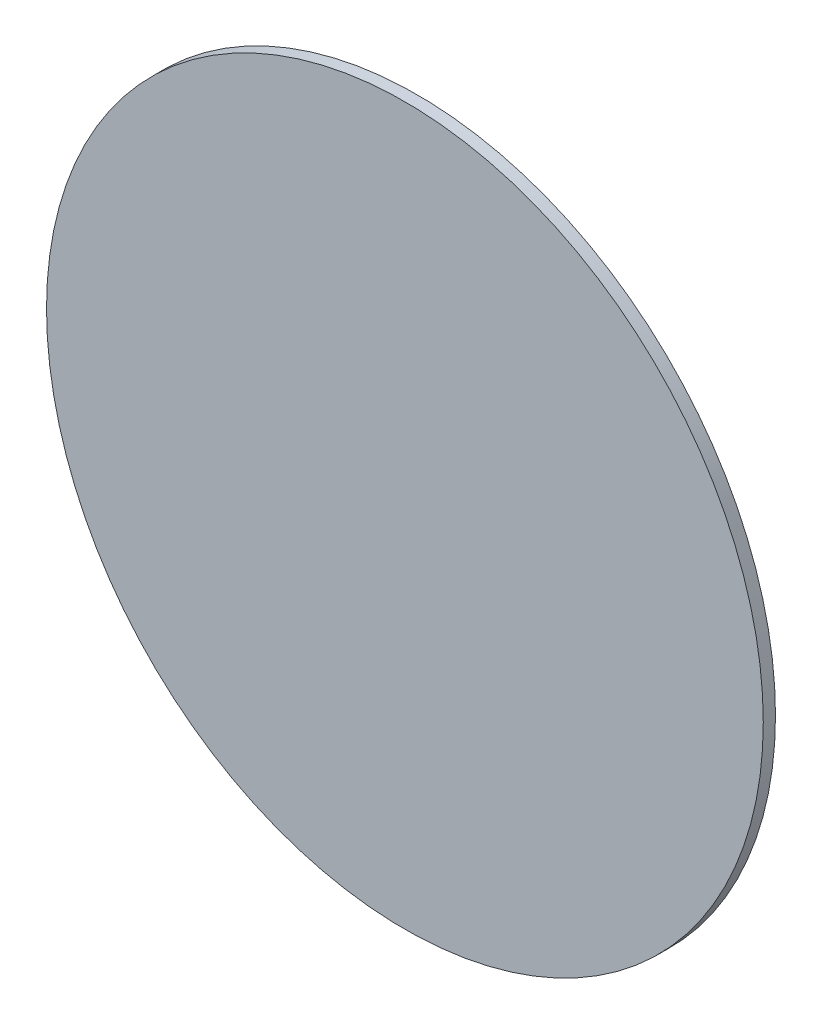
ISO-10303-21;
HEADER;
FILE_DESCRIPTION(('STEP AP214'),'2;1');
FILE_NAME('part.step','',(''),(''),'','','');
FILE_SCHEMA(('AUTOMOTIVE_DESIGN { 1 0 10303 214 1 1 1 1 }'));
ENDSEC;
DATA;
#1=APPLICATION_CONTEXT('core data for automotive mechanical design processes');
#2=APPLICATION_PROTOCOL_DEFINITION('international standard','automotive_design',2000,#1);
#3=PRODUCT_CONTEXT('',#1,'mechanical');
#4=PRODUCT('Part','Part','',(#3));
#5=PRODUCT_RELATED_PRODUCT_CATEGORY('part','',(#4));
#6=PRODUCT_DEFINITION_FORMATION('','',#4);
#7=PRODUCT_DEFINITION_CONTEXT('part definition',#1,'design');
#8=PRODUCT_DEFINITION('design','',#6,#7);
#9=PRODUCT_DEFINITION_SHAPE('','',#8);
#10=(LENGTH_UNIT() NAMED_UNIT(*) SI_UNIT(.MILLI.,.METRE.));
#11=(NAMED_UNIT(*) PLANE_ANGLE_UNIT() SI_UNIT($,.RADIAN.));
#12=(NAMED_UNIT(*) SI_UNIT($,.STERADIAN.) SOLID_ANGLE_UNIT());
#13=UNCERTAINTY_MEASURE_WITH_UNIT(LENGTH_MEASURE(1.E-05),#10,'distance_accuracy_value','');
#14=(GEOMETRIC_REPRESENTATION_CONTEXT(3) GLOBAL_UNCERTAINTY_ASSIGNED_CONTEXT((#13)) GLOBAL_UNIT_ASSIGNED_CONTEXT((#10,
#11,#12)) REPRESENTATION_CONTEXT('',''));
#15=CARTESIAN_POINT('',(0.,0.,0.));
#16=DIRECTION('',(0.,0.,1.));
#17=DIRECTION('',(1.,0.,0.));
#18=AXIS2_PLACEMENT_3D('',#15,#16,#17);
#19=CARTESIAN_POINT('',(0.,0.,0.));
#20=DIRECTION('',(0.,0.,-1.));
#21=DIRECTION('',(-1.,0.,0.));
#22=AXIS2_PLACEMENT_3D('',#19,#20,#21);
#23=PLANE('',#22);
#24=CARTESIAN_POINT('',(0.,0.,0.));
#25=DIRECTION('',(0.,0.,1.));
#26=DIRECTION('',(1.,0.,0.));
#27=AXIS2_PLACEMENT_3D('',#24,#25,#26);
#28=CIRCLE('',#27,8.9535);
#29=CARTESIAN_POINT('',(8.9535,0.,0.));
#30=VERTEX_POINT('',#29);
#31=EDGE_CURVE('E52',#30,#30,#28,.T.);
#32=ORIENTED_EDGE('',*,*,#31,.T.);
#33=EDGE_LOOP('',(#32));
#34=FACE_BOUND('',#33,.T.);
#35=ADVANCED_FACE('F32',(#34),#23,.F.);
#36=CARTESIAN_POINT('',(0.,0.,3.92892485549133));
#37=DIRECTION('',(0.,0.,1.));
#38=DIRECTION('',(1.,0.,0.));
#39=AXIS2_PLACEMENT_3D('',#36,#37,#38);
#40=CYLINDRICAL_SURFACE('',#39,8.9535);
#41=ORIENTED_EDGE('',*,*,#31,.F.);
#42=EDGE_LOOP('',(#41));
#43=FACE_BOUND('',#42,.T.);
#44=CARTESIAN_POINT('',(0.,0.,-0.3048));
#45=DIRECTION('',(0.,0.,1.));
#46=DIRECTION('',(1.,0.,0.));
#47=AXIS2_PLACEMENT_3D('',#44,#45,#46);
#48=CIRCLE('',#47,8.9535);
#49=CARTESIAN_POINT('',(8.9535,0.,-0.3048));
#50=VERTEX_POINT('',#49);
#51=EDGE_CURVE('E55',#50,#50,#48,.T.);
#52=ORIENTED_EDGE('',*,*,#51,.T.);
#53=EDGE_LOOP('',(#52));
#54=FACE_BOUND('',#53,.T.);
#55=ADVANCED_FACE('F59',(#43,#54),#40,.T.);
#56=CARTESIAN_POINT('',(0.,8.9535,-0.3048));
#57=DIRECTION('',(0.,0.,1.));
#58=DIRECTION('',(1.,0.,0.));
#59=AXIS2_PLACEMENT_3D('',#56,#57,#58);
#60=PLANE('',#59);
#61=CARTESIAN_POINT('',(0.,0.,-0.3048));
#62=DIRECTION('',(0.,0.,1.));
#63=DIRECTION('',(1.,0.,0.));
#64=AXIS2_PLACEMENT_3D('',#61,#62,#63);
#65=CIRCLE('',#64,5.57672119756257);
#66=CARTESIAN_POINT('',(5.57672119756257,0.,-0.3048));
#67=VERTEX_POINT('',#66);
#68=EDGE_CURVE('E10',#67,#67,#65,.T.);
#69=ORIENTED_EDGE('',*,*,#68,.T.);
#70=EDGE_LOOP('',(#69));
#71=FACE_BOUND('',#70,.T.);
#72=ORIENTED_EDGE('',*,*,#51,.F.);
#73=EDGE_LOOP('',(#72));
#74=FACE_BOUND('',#73,.T.);
#75=ADVANCED_FACE('F61',(#71,#74),#60,.F.);
#76=CARTESIAN_POINT('',(0.,0.,-0.889));
#77=DIRECTION('',(0.,0.,1.));
#78=DIRECTION('',(1.,0.,0.));
#79=AXIS2_PLACEMENT_3D('',#76,#77,#78);
#80=CONICAL_SURFACE('',#79,4.445,1.02063054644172);
#81=CARTESIAN_POINT('',(0.,0.,-0.795298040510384));
#82=DIRECTION('',(0.,0.,-1.));
#83=DIRECTION('',(-1.,0.,0.));
#84=AXIS2_PLACEMENT_3D('',#81,#82,#83);
#85=CIRCLE('',#84,4.59777493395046);
#86=CARTESIAN_POINT('',(-4.59777493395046,0.,-0.795298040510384));
#87=VERTEX_POINT('',#86);
#88=EDGE_CURVE('E43',#87,#87,#85,.F.);
#89=ORIENTED_EDGE('',*,*,#88,.T.);
#90=EDGE_LOOP('',(#89));
#91=FACE_BOUND('',#90,.T.);
#92=CARTESIAN_POINT('',(0.,0.,-0.398501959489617));
#93=DIRECTION('',(0.,0.,1.));
#94=DIRECTION('',(1.,0.,0.));
#95=AXIS2_PLACEMENT_3D('',#92,#93,#94);
#96=CIRCLE('',#95,5.24472506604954);
#97=CARTESIAN_POINT('',(5.24472506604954,0.,-0.398501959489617));
#98=VERTEX_POINT('',#97);
#99=EDGE_CURVE('E47',#98,#98,#96,.F.);
#100=ORIENTED_EDGE('',*,*,#99,.T.);
#101=EDGE_LOOP('',(#100));
#102=FACE_BOUND('',#101,.T.);
#103=ADVANCED_FACE('F63',(#91,#102),#80,.T.);
#104=CARTESIAN_POINT('',(0.,4.445,-0.889));
#105=DIRECTION('',(0.,0.,1.));
#106=DIRECTION('',(1.,0.,0.));
#107=AXIS2_PLACEMENT_3D('',#104,#105,#106);
#108=PLANE('',#107);
#109=CARTESIAN_POINT('',(0.,0.,-0.889));
#110=DIRECTION('',(0.,0.,1.));
#111=DIRECTION('',(1.,0.,0.));
#112=AXIS2_PLACEMENT_3D('',#109,#110,#111);
#113=CIRCLE('',#112,4.26577880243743);
#114=CARTESIAN_POINT('',(4.26577880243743,0.,-0.889));
#115=VERTEX_POINT('',#114);
#116=EDGE_CURVE('E39',#115,#115,#113,.F.);
#117=ORIENTED_EDGE('',*,*,#116,.T.);
#118=EDGE_LOOP('',(#117));
#119=FACE_BOUND('',#118,.T.);
#120=ADVANCED_FACE('F69',(#119),#108,.F.);
#121=CARTESIAN_POINT('',(0.,0.,-0.254));
#122=DIRECTION('',(0.,0.,1.));
#123=DIRECTION('',(1.,0.,0.));
#124=AXIS2_PLACEMENT_3D('',#121,#122,#123);
#125=TOROIDAL_SURFACE('',#124,4.26577880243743,0.635);
#126=ORIENTED_EDGE('',*,*,#116,.F.);
#127=EDGE_LOOP('',(#126));
#128=FACE_BOUND('',#127,.T.);
#129=ORIENTED_EDGE('',*,*,#88,.F.);
#130=EDGE_LOOP('',(#129));
#131=FACE_BOUND('',#130,.T.);
#132=ADVANCED_FACE('F79',(#128,#131),#125,.T.);
#133=CARTESIAN_POINT('',(0.,0.,-0.9398));
#134=DIRECTION('',(0.,0.,1.));
#135=DIRECTION('',(1.,0.,0.));
#136=AXIS2_PLACEMENT_3D('',#133,#134,#135);
#137=TOROIDAL_SURFACE('',#136,5.57672119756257,0.635);
#138=ORIENTED_EDGE('',*,*,#99,.F.);
#139=EDGE_LOOP('',(#138));
#140=FACE_BOUND('',#139,.T.);
#141=ORIENTED_EDGE('',*,*,#68,.F.);
#142=EDGE_LOOP('',(#141));
#143=FACE_BOUND('',#142,.T.);
#144=ADVANCED_FACE('F34',(#140,#143),#137,.F.);
#145=CLOSED_SHELL('',(#35,#55,#75,#103,#120,#132,#144));
#146=MANIFOLD_SOLID_BREP('B2',#145);
#147=ADVANCED_BREP_SHAPE_REPRESENTATION('',(#18,#146),#14);
#148=SHAPE_DEFINITION_REPRESENTATION(#9,#147);
ENDSEC;
END-ISO-10303-21;
